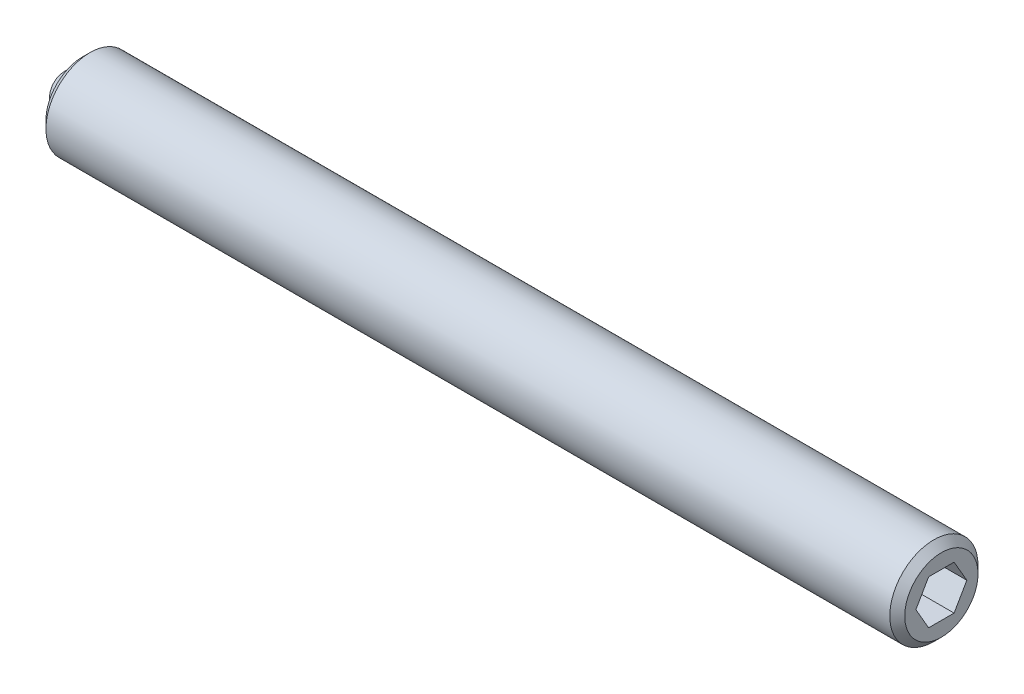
ISO-10303-21;
HEADER;
FILE_DESCRIPTION(('STEP AP214'),'2;1');
FILE_NAME('part.step','',(''),(''),'','','');
FILE_SCHEMA(('AUTOMOTIVE_DESIGN { 1 0 10303 214 1 1 1 1 }'));
ENDSEC;
DATA;
#1=APPLICATION_CONTEXT('core data for automotive mechanical design processes');
#2=APPLICATION_PROTOCOL_DEFINITION('international standard','automotive_design',2000,#1);
#3=PRODUCT_CONTEXT('',#1,'mechanical');
#4=PRODUCT('Part','Part','',(#3));
#5=PRODUCT_RELATED_PRODUCT_CATEGORY('part','',(#4));
#6=PRODUCT_DEFINITION_FORMATION('','',#4);
#7=PRODUCT_DEFINITION_CONTEXT('part definition',#1,'design');
#8=PRODUCT_DEFINITION('design','',#6,#7);
#9=PRODUCT_DEFINITION_SHAPE('','',#8);
#10=(LENGTH_UNIT() NAMED_UNIT(*) SI_UNIT(.MILLI.,.METRE.));
#11=(NAMED_UNIT(*) PLANE_ANGLE_UNIT() SI_UNIT($,.RADIAN.));
#12=(NAMED_UNIT(*) SI_UNIT($,.STERADIAN.) SOLID_ANGLE_UNIT());
#13=UNCERTAINTY_MEASURE_WITH_UNIT(LENGTH_MEASURE(1.E-05),#10,'distance_accuracy_value','');
#14=(GEOMETRIC_REPRESENTATION_CONTEXT(3) GLOBAL_UNCERTAINTY_ASSIGNED_CONTEXT((#13)) GLOBAL_UNIT_ASSIGNED_CONTEXT((#10,
#11,#12)) REPRESENTATION_CONTEXT('',''));
#15=CARTESIAN_POINT('',(0.,0.,0.));
#16=DIRECTION('',(0.,0.,1.));
#17=DIRECTION('',(1.,0.,0.));
#18=AXIS2_PLACEMENT_3D('',#15,#16,#17);
#19=CARTESIAN_POINT('',(0.,0.,0.));
#20=DIRECTION('',(0.,-1.,0.));
#21=DIRECTION('',(0.,0.,-1.));
#22=AXIS2_PLACEMENT_3D('',#19,#20,#21);
#23=SPHERICAL_SURFACE('',#22,0.8);
#24=CARTESIAN_POINT('',(0.,-0.8,0.));
#25=VERTEX_POINT('',#24);
#26=VERTEX_LOOP('',#25);
#27=FACE_BOUND('',#26,.T.);
#28=ADVANCED_FACE('F41',(#27),#23,.T.);
#29=CLOSED_SHELL('',(#28));
#30=MANIFOLD_SOLID_BREP('B2',#29);
#31=CARTESIAN_POINT('',(29.2,0.,0.));
#32=DIRECTION('',(-1.,0.,0.));
#33=DIRECTION('',(0.,0.,1.));
#34=AXIS2_PLACEMENT_3D('',#31,#32,#33);
#35=CYLINDRICAL_SURFACE('',#34,1.5);
#36=CARTESIAN_POINT('',(28.946,0.,0.));
#37=DIRECTION('',(1.,0.,0.));
#38=DIRECTION('',(0.,0.,-1.));
#39=AXIS2_PLACEMENT_3D('',#36,#37,#38);
#40=CIRCLE('',#39,1.5);
#41=CARTESIAN_POINT('',(28.946,0.,-1.5));
#42=VERTEX_POINT('',#41);
#43=EDGE_CURVE('E39',#42,#42,#40,.F.);
#44=ORIENTED_EDGE('',*,*,#43,.T.);
#45=EDGE_LOOP('',(#44));
#46=FACE_BOUND('',#45,.T.);
#47=CARTESIAN_POINT('',(0.254000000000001,0.,0.));
#48=DIRECTION('',(1.,0.,0.));
#49=DIRECTION('',(0.,0.,-1.));
#50=AXIS2_PLACEMENT_3D('',#47,#48,#49);
#51=CIRCLE('',#50,1.5);
#52=CARTESIAN_POINT('',(0.254000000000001,0.,-1.5));
#53=VERTEX_POINT('',#52);
#54=EDGE_CURVE('E157',#53,#53,#51,.T.);
#55=ORIENTED_EDGE('',*,*,#54,.T.);
#56=EDGE_LOOP('',(#55));
#57=FACE_BOUND('',#56,.T.);
#58=ADVANCED_FACE('F54',(#46,#57),#35,.T.);
#59=CARTESIAN_POINT('',(29.2,0.,0.));
#60=DIRECTION('',(1.,0.,0.));
#61=DIRECTION('',(0.,0.,-1.));
#62=AXIS2_PLACEMENT_3D('',#59,#60,#61);
#63=PLANE('',#62);
#64=DIRECTION('',(0.,0.866025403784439,-0.5));
#65=VECTOR('',#64,1.);
#66=CARTESIAN_POINT('',(29.2,-0.75,-0.43301270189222));
#67=LINE('',#66,#65);
#68=CARTESIAN_POINT('',(29.2,-0.75,-0.43301270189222));
#69=VERTEX_POINT('',#68);
#70=CARTESIAN_POINT('',(29.2,0.,-0.866025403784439));
#71=VERTEX_POINT('',#70);
#72=EDGE_CURVE('E69',#69,#71,#67,.T.);
#73=ORIENTED_EDGE('',*,*,#72,.F.);
#74=DIRECTION('',(0.,0.,-1.));
#75=VECTOR('',#74,1.);
#76=CARTESIAN_POINT('',(29.2,-0.75,0.433012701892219));
#77=LINE('',#76,#75);
#78=CARTESIAN_POINT('',(29.2,-0.75,0.433012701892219));
#79=VERTEX_POINT('',#78);
#80=EDGE_CURVE('E153',#79,#69,#77,.T.);
#81=ORIENTED_EDGE('',*,*,#80,.F.);
#82=DIRECTION('',(0.,-0.866025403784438,-0.5));
#83=VECTOR('',#82,1.);
#84=CARTESIAN_POINT('',(29.2,0.,0.866025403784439));
#85=LINE('',#84,#83);
#86=CARTESIAN_POINT('',(29.2,0.,0.866025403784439));
#87=VERTEX_POINT('',#86);
#88=EDGE_CURVE('E151',#87,#79,#85,.T.);
#89=ORIENTED_EDGE('',*,*,#88,.F.);
#90=DIRECTION('',(0.,-0.866025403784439,0.5));
#91=VECTOR('',#90,1.);
#92=CARTESIAN_POINT('',(29.2,0.75,0.433012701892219));
#93=LINE('',#92,#91);
#94=CARTESIAN_POINT('',(29.2,0.75,0.433012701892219));
#95=VERTEX_POINT('',#94);
#96=EDGE_CURVE('E117',#95,#87,#93,.T.);
#97=ORIENTED_EDGE('',*,*,#96,.F.);
#98=DIRECTION('',(0.,0.,1.));
#99=VECTOR('',#98,1.);
#100=CARTESIAN_POINT('',(29.2,0.75,-0.433012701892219));
#101=LINE('',#100,#99);
#102=CARTESIAN_POINT('',(29.2,0.75,-0.433012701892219));
#103=VERTEX_POINT('',#102);
#104=EDGE_CURVE('E147',#103,#95,#101,.T.);
#105=ORIENTED_EDGE('',*,*,#104,.F.);
#106=DIRECTION('',(0.,0.866025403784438,0.5));
#107=VECTOR('',#106,1.);
#108=CARTESIAN_POINT('',(29.2,0.,-0.866025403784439));
#109=LINE('',#108,#107);
#110=EDGE_CURVE('E143',#71,#103,#109,.T.);
#111=ORIENTED_EDGE('',*,*,#110,.F.);
#112=EDGE_LOOP('',(#73,#81,#89,#97,#105,#111));
#113=FACE_BOUND('',#112,.T.);
#114=CARTESIAN_POINT('',(29.2,0.,0.));
#115=DIRECTION('',(1.,0.,0.));
#116=DIRECTION('',(0.,0.,-1.));
#117=AXIS2_PLACEMENT_3D('',#114,#115,#116);
#118=CIRCLE('',#117,1.246);
#119=CARTESIAN_POINT('',(29.2,0.,-1.246));
#120=VERTEX_POINT('',#119);
#121=EDGE_CURVE('E62',#120,#120,#118,.T.);
#122=ORIENTED_EDGE('',*,*,#121,.T.);
#123=EDGE_LOOP('',(#122));
#124=FACE_BOUND('',#123,.T.);
#125=ADVANCED_FACE('F170',(#113,#124),#63,.T.);
#126=CARTESIAN_POINT('',(0.,0.,0.));
#127=DIRECTION('',(1.,0.,0.));
#128=DIRECTION('',(0.,0.,-1.));
#129=AXIS2_PLACEMENT_3D('',#126,#127,#128);
#130=PLANE('',#129);
#131=CARTESIAN_POINT('',(0.,0.,0.));
#132=DIRECTION('',(-1.,0.,0.));
#133=DIRECTION('',(0.,0.,1.));
#134=AXIS2_PLACEMENT_3D('',#131,#132,#133);
#135=CIRCLE('',#134,0.8);
#136=CARTESIAN_POINT('',(0.,0.,0.8));
#137=VERTEX_POINT('',#136);
#138=EDGE_CURVE('E225',#137,#137,#135,.T.);
#139=ORIENTED_EDGE('',*,*,#138,.F.);
#140=EDGE_LOOP('',(#139));
#141=FACE_BOUND('',#140,.T.);
#142=CARTESIAN_POINT('',(0.,0.,0.));
#143=DIRECTION('',(1.,0.,0.));
#144=DIRECTION('',(0.,0.,-1.));
#145=AXIS2_PLACEMENT_3D('',#142,#143,#144);
#146=CIRCLE('',#145,1.246);
#147=CARTESIAN_POINT('',(0.,0.,-1.246));
#148=VERTEX_POINT('',#147);
#149=EDGE_CURVE('E165',#148,#148,#146,.F.);
#150=ORIENTED_EDGE('',*,*,#149,.T.);
#151=EDGE_LOOP('',(#150));
#152=FACE_BOUND('',#151,.T.);
#153=ADVANCED_FACE('F182',(#141,#152),#130,.F.);
#154=CARTESIAN_POINT('',(0.254000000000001,0.,0.));
#155=DIRECTION('',(1.,0.,0.));
#156=DIRECTION('',(0.,0.,-1.));
#157=AXIS2_PLACEMENT_3D('',#154,#155,#156);
#158=CONICAL_SURFACE('',#157,1.5,0.785398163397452);
#159=ORIENTED_EDGE('',*,*,#149,.F.);
#160=EDGE_LOOP('',(#159));
#161=FACE_BOUND('',#160,.T.);
#162=ORIENTED_EDGE('',*,*,#54,.F.);
#163=EDGE_LOOP('',(#162));
#164=FACE_BOUND('',#163,.T.);
#165=ADVANCED_FACE('F174',(#161,#164),#158,.T.);
#166=CARTESIAN_POINT('',(29.2,0.,0.));
#167=DIRECTION('',(-1.,0.,0.));
#168=DIRECTION('',(0.,0.,1.));
#169=AXIS2_PLACEMENT_3D('',#166,#167,#168);
#170=CONICAL_SURFACE('',#169,1.246,0.785398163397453);
#171=ORIENTED_EDGE('',*,*,#43,.F.);
#172=EDGE_LOOP('',(#171));
#173=FACE_BOUND('',#172,.T.);
#174=ORIENTED_EDGE('',*,*,#121,.F.);
#175=EDGE_LOOP('',(#174));
#176=FACE_BOUND('',#175,.T.);
#177=ADVANCED_FACE('F56',(#173,#176),#170,.T.);
#178=CARTESIAN_POINT('',(27.2,-0.75,-0.43301270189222));
#179=DIRECTION('',(0.,-0.5,-0.866025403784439));
#180=DIRECTION('',(0.,0.866025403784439,-0.5));
#181=AXIS2_PLACEMENT_3D('',#178,#179,#180);
#182=PLANE('',#181);
#183=ORIENTED_EDGE('',*,*,#72,.T.);
#184=DIRECTION('',(1.,0.,0.));
#185=VECTOR('',#184,1.);
#186=CARTESIAN_POINT('',(27.2,0.,-0.866025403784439));
#187=LINE('',#186,#185);
#188=CARTESIAN_POINT('',(27.2,0.,-0.866025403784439));
#189=VERTEX_POINT('',#188);
#190=EDGE_CURVE('E99',#189,#71,#187,.T.);
#191=ORIENTED_EDGE('',*,*,#190,.F.);
#192=DIRECTION('',(0.,0.866025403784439,-0.5));
#193=VECTOR('',#192,1.);
#194=CARTESIAN_POINT('',(27.2,-0.75,-0.43301270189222));
#195=LINE('',#194,#193);
#196=CARTESIAN_POINT('',(27.2,-0.75,-0.43301270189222));
#197=VERTEX_POINT('',#196);
#198=EDGE_CURVE('E155',#197,#189,#195,.T.);
#199=ORIENTED_EDGE('',*,*,#198,.F.);
#200=DIRECTION('',(1.,0.,0.));
#201=VECTOR('',#200,1.);
#202=CARTESIAN_POINT('',(27.2,-0.75,-0.43301270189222));
#203=LINE('',#202,#201);
#204=EDGE_CURVE('E77',#197,#69,#203,.T.);
#205=ORIENTED_EDGE('',*,*,#204,.T.);
#206=EDGE_LOOP('',(#183,#191,#199,#205));
#207=FACE_BOUND('',#206,.T.);
#208=ADVANCED_FACE('F173',(#207),#182,.F.);
#209=CARTESIAN_POINT('',(27.2,-0.75,0.433012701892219));
#210=DIRECTION('',(0.,-1.,0.));
#211=DIRECTION('',(0.,0.,-1.));
#212=AXIS2_PLACEMENT_3D('',#209,#210,#211);
#213=PLANE('',#212);
#214=ORIENTED_EDGE('',*,*,#80,.T.);
#215=ORIENTED_EDGE('',*,*,#204,.F.);
#216=DIRECTION('',(0.,0.,-1.));
#217=VECTOR('',#216,1.);
#218=CARTESIAN_POINT('',(27.2,-0.75,0.433012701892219));
#219=LINE('',#218,#217);
#220=CARTESIAN_POINT('',(27.2,-0.75,0.433012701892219));
#221=VERTEX_POINT('',#220);
#222=EDGE_CURVE('E129',#221,#197,#219,.T.);
#223=ORIENTED_EDGE('',*,*,#222,.F.);
#224=DIRECTION('',(1.,0.,0.));
#225=VECTOR('',#224,1.);
#226=CARTESIAN_POINT('',(27.2,-0.75,0.433012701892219));
#227=LINE('',#226,#225);
#228=EDGE_CURVE('E121',#221,#79,#227,.T.);
#229=ORIENTED_EDGE('',*,*,#228,.T.);
#230=EDGE_LOOP('',(#214,#215,#223,#229));
#231=FACE_BOUND('',#230,.T.);
#232=ADVANCED_FACE('F180',(#231),#213,.F.);
#233=CARTESIAN_POINT('',(27.2,0.,0.866025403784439));
#234=DIRECTION('',(0.,-0.5,0.866025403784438));
#235=DIRECTION('',(0.,-0.866025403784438,-0.5));
#236=AXIS2_PLACEMENT_3D('',#233,#234,#235);
#237=PLANE('',#236);
#238=ORIENTED_EDGE('',*,*,#88,.T.);
#239=ORIENTED_EDGE('',*,*,#228,.F.);
#240=DIRECTION('',(0.,-0.866025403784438,-0.5));
#241=VECTOR('',#240,1.);
#242=CARTESIAN_POINT('',(27.2,0.,0.866025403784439));
#243=LINE('',#242,#241);
#244=CARTESIAN_POINT('',(27.2,0.,0.866025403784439));
#245=VERTEX_POINT('',#244);
#246=EDGE_CURVE('E125',#245,#221,#243,.T.);
#247=ORIENTED_EDGE('',*,*,#246,.F.);
#248=DIRECTION('',(1.,0.,0.));
#249=VECTOR('',#248,1.);
#250=CARTESIAN_POINT('',(27.2,0.,0.866025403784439));
#251=LINE('',#250,#249);
#252=EDGE_CURVE('E110',#245,#87,#251,.T.);
#253=ORIENTED_EDGE('',*,*,#252,.T.);
#254=EDGE_LOOP('',(#238,#239,#247,#253));
#255=FACE_BOUND('',#254,.T.);
#256=ADVANCED_FACE('F126',(#255),#237,.F.);
#257=CARTESIAN_POINT('',(27.2,0.75,0.433012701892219));
#258=DIRECTION('',(0.,0.5,0.866025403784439));
#259=DIRECTION('',(0.,-0.866025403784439,0.5));
#260=AXIS2_PLACEMENT_3D('',#257,#258,#259);
#261=PLANE('',#260);
#262=ORIENTED_EDGE('',*,*,#96,.T.);
#263=ORIENTED_EDGE('',*,*,#252,.F.);
#264=DIRECTION('',(0.,-0.866025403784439,0.5));
#265=VECTOR('',#264,1.);
#266=CARTESIAN_POINT('',(27.2,0.75,0.433012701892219));
#267=LINE('',#266,#265);
#268=CARTESIAN_POINT('',(27.2,0.75,0.433012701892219));
#269=VERTEX_POINT('',#268);
#270=EDGE_CURVE('E114',#269,#245,#267,.T.);
#271=ORIENTED_EDGE('',*,*,#270,.F.);
#272=DIRECTION('',(1.,0.,0.));
#273=VECTOR('',#272,1.);
#274=CARTESIAN_POINT('',(27.2,0.75,0.433012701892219));
#275=LINE('',#274,#273);
#276=EDGE_CURVE('E122',#269,#95,#275,.T.);
#277=ORIENTED_EDGE('',*,*,#276,.T.);
#278=EDGE_LOOP('',(#262,#263,#271,#277));
#279=FACE_BOUND('',#278,.T.);
#280=ADVANCED_FACE('F112',(#279),#261,.F.);
#281=CARTESIAN_POINT('',(27.2,0.75,-0.433012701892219));
#282=DIRECTION('',(0.,1.,0.));
#283=DIRECTION('',(0.,0.,1.));
#284=AXIS2_PLACEMENT_3D('',#281,#282,#283);
#285=PLANE('',#284);
#286=ORIENTED_EDGE('',*,*,#104,.T.);
#287=ORIENTED_EDGE('',*,*,#276,.F.);
#288=DIRECTION('',(0.,0.,1.));
#289=VECTOR('',#288,1.);
#290=CARTESIAN_POINT('',(27.2,0.75,-0.433012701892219));
#291=LINE('',#290,#289);
#292=CARTESIAN_POINT('',(27.2,0.75,-0.433012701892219));
#293=VERTEX_POINT('',#292);
#294=EDGE_CURVE('E135',#293,#269,#291,.T.);
#295=ORIENTED_EDGE('',*,*,#294,.F.);
#296=DIRECTION('',(1.,0.,0.));
#297=VECTOR('',#296,1.);
#298=CARTESIAN_POINT('',(27.2,0.75,-0.433012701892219));
#299=LINE('',#298,#297);
#300=EDGE_CURVE('E160',#293,#103,#299,.T.);
#301=ORIENTED_EDGE('',*,*,#300,.T.);
#302=EDGE_LOOP('',(#286,#287,#295,#301));
#303=FACE_BOUND('',#302,.T.);
#304=ADVANCED_FACE('F201',(#303),#285,.F.);
#305=CARTESIAN_POINT('',(27.2,0.,-0.866025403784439));
#306=DIRECTION('',(0.,0.500000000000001,-0.866025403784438));
#307=DIRECTION('',(0.,0.866025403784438,0.500000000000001));
#308=AXIS2_PLACEMENT_3D('',#305,#306,#307);
#309=PLANE('',#308);
#310=ORIENTED_EDGE('',*,*,#110,.T.);
#311=ORIENTED_EDGE('',*,*,#300,.F.);
#312=DIRECTION('',(0.,0.866025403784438,0.5));
#313=VECTOR('',#312,1.);
#314=CARTESIAN_POINT('',(27.2,0.,-0.866025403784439));
#315=LINE('',#314,#313);
#316=EDGE_CURVE('E137',#189,#293,#315,.T.);
#317=ORIENTED_EDGE('',*,*,#316,.F.);
#318=ORIENTED_EDGE('',*,*,#190,.T.);
#319=EDGE_LOOP('',(#310,#311,#317,#318));
#320=FACE_BOUND('',#319,.T.);
#321=ADVANCED_FACE('F198',(#320),#309,.F.);
#322=CARTESIAN_POINT('',(27.2,0.,0.));
#323=DIRECTION('',(1.,0.,0.));
#324=DIRECTION('',(0.,0.,-1.));
#325=AXIS2_PLACEMENT_3D('',#322,#323,#324);
#326=PLANE('',#325);
#327=ORIENTED_EDGE('',*,*,#198,.T.);
#328=ORIENTED_EDGE('',*,*,#316,.T.);
#329=ORIENTED_EDGE('',*,*,#294,.T.);
#330=ORIENTED_EDGE('',*,*,#270,.T.);
#331=ORIENTED_EDGE('',*,*,#246,.T.);
#332=ORIENTED_EDGE('',*,*,#222,.T.);
#333=EDGE_LOOP('',(#327,#328,#329,#330,#331,#332));
#334=FACE_BOUND('',#333,.T.);
#335=ADVANCED_FACE('F132',(#334),#326,.T.);
#336=CARTESIAN_POINT('',(0.8,0.,0.));
#337=DIRECTION('',(-1.,0.,0.));
#338=DIRECTION('',(0.,0.,1.));
#339=AXIS2_PLACEMENT_3D('',#336,#337,#338);
#340=CYLINDRICAL_SURFACE('',#339,0.8);
#341=CARTESIAN_POINT('',(0.8,0.,0.));
#342=DIRECTION('',(-1.,0.,0.));
#343=DIRECTION('',(0.,0.,1.));
#344=AXIS2_PLACEMENT_3D('',#341,#342,#343);
#345=CIRCLE('',#344,0.8);
#346=CARTESIAN_POINT('',(0.8,0.,0.8));
#347=VERTEX_POINT('',#346);
#348=EDGE_CURVE('E144',#347,#347,#345,.T.);
#349=ORIENTED_EDGE('',*,*,#348,.F.);
#350=EDGE_LOOP('',(#349));
#351=FACE_BOUND('',#350,.T.);
#352=ORIENTED_EDGE('',*,*,#138,.T.);
#353=EDGE_LOOP('',(#352));
#354=FACE_BOUND('',#353,.T.);
#355=ADVANCED_FACE('F214',(#351,#354),#340,.F.);
#356=CARTESIAN_POINT('',(0.8,0.,0.));
#357=DIRECTION('',(-1.,0.,0.));
#358=DIRECTION('',(0.,0.,1.));
#359=AXIS2_PLACEMENT_3D('',#356,#357,#358);
#360=PLANE('',#359);
#361=ORIENTED_EDGE('',*,*,#348,.T.);
#362=EDGE_LOOP('',(#361));
#363=FACE_BOUND('',#362,.T.);
#364=ADVANCED_FACE('F217',(#363),#360,.T.);
#365=CLOSED_SHELL('',(#58,#125,#153,#165,#177,#208,#232,#256,#280,#304,#321,#335,#355,#364));
#366=MANIFOLD_SOLID_BREP('B6',#365);
#367=ADVANCED_BREP_SHAPE_REPRESENTATION('',(#18,#30,#366),#14);
#368=SHAPE_DEFINITION_REPRESENTATION(#9,#367);
ENDSEC;
END-ISO-10303-21;
